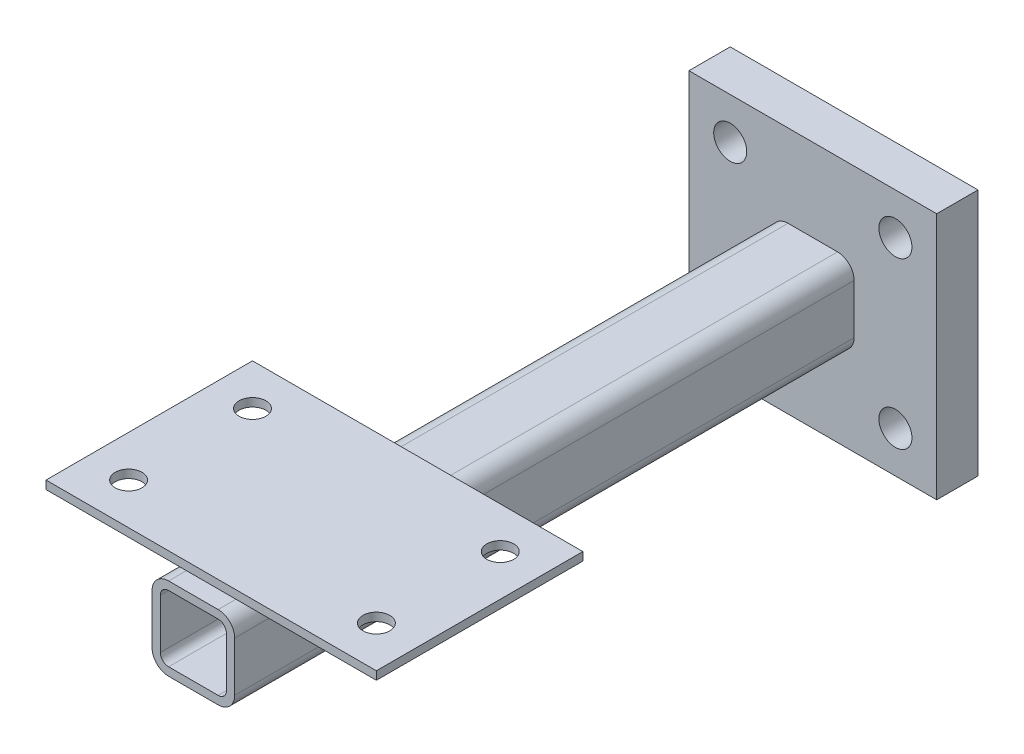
ISO-10303-21;
HEADER;
FILE_DESCRIPTION(('STEP AP214'),'2;1');
FILE_NAME('part.step','',(''),(''),'','','');
FILE_SCHEMA(('AUTOMOTIVE_DESIGN { 1 0 10303 214 1 1 1 1 }'));
ENDSEC;
DATA;
#1=APPLICATION_CONTEXT('core data for automotive mechanical design processes');
#2=APPLICATION_PROTOCOL_DEFINITION('international standard','automotive_design',2000,#1);
#3=PRODUCT_CONTEXT('',#1,'mechanical');
#4=PRODUCT('Part','Part','',(#3));
#5=PRODUCT_RELATED_PRODUCT_CATEGORY('part','',(#4));
#6=PRODUCT_DEFINITION_FORMATION('','',#4);
#7=PRODUCT_DEFINITION_CONTEXT('part definition',#1,'design');
#8=PRODUCT_DEFINITION('design','',#6,#7);
#9=PRODUCT_DEFINITION_SHAPE('','',#8);
#10=(LENGTH_UNIT() NAMED_UNIT(*) SI_UNIT(.MILLI.,.METRE.));
#11=(NAMED_UNIT(*) PLANE_ANGLE_UNIT() SI_UNIT($,.RADIAN.));
#12=(NAMED_UNIT(*) SI_UNIT($,.STERADIAN.) SOLID_ANGLE_UNIT());
#13=UNCERTAINTY_MEASURE_WITH_UNIT(LENGTH_MEASURE(1.E-05),#10,'distance_accuracy_value','');
#14=(GEOMETRIC_REPRESENTATION_CONTEXT(3) GLOBAL_UNCERTAINTY_ASSIGNED_CONTEXT((#13)) GLOBAL_UNIT_ASSIGNED_CONTEXT((#10,
#11,#12)) REPRESENTATION_CONTEXT('',''));
#15=CARTESIAN_POINT('',(0.,0.,0.));
#16=DIRECTION('',(0.,0.,1.));
#17=DIRECTION('',(1.,0.,0.));
#18=AXIS2_PLACEMENT_3D('',#15,#16,#17);
#19=CARTESIAN_POINT('',(40.,12.,105.685967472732));
#20=DIRECTION('',(-1.,0.,0.));
#21=DIRECTION('',(0.,0.,1.));
#22=AXIS2_PLACEMENT_3D('',#19,#20,#21);
#23=PLANE('',#22);
#24=DIRECTION('',(0.,0.,-1.));
#25=VECTOR('',#24,1.);
#26=CARTESIAN_POINT('',(40.,9.99999999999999,105.685967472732));
#27=LINE('',#26,#25);
#28=CARTESIAN_POINT('',(40.,9.99999999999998,155.685967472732));
#29=VERTEX_POINT('',#28);
#30=CARTESIAN_POINT('',(40.,9.99999999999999,105.685967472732));
#31=VERTEX_POINT('',#30);
#32=EDGE_CURVE('E170',#29,#31,#27,.T.);
#33=ORIENTED_EDGE('',*,*,#32,.T.);
#34=DIRECTION('',(0.,-1.,0.));
#35=VECTOR('',#34,1.);
#36=CARTESIAN_POINT('',(40.,12.,105.685967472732));
#37=LINE('',#36,#35);
#38=CARTESIAN_POINT('',(40.,12.,105.685967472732));
#39=VERTEX_POINT('',#38);
#40=EDGE_CURVE('E13',#39,#31,#37,.T.);
#41=ORIENTED_EDGE('',*,*,#40,.F.);
#42=DIRECTION('',(0.,0.,-1.));
#43=VECTOR('',#42,1.);
#44=CARTESIAN_POINT('',(40.,12.,105.685967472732));
#45=LINE('',#44,#43);
#46=CARTESIAN_POINT('',(40.,12.,155.685967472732));
#47=VERTEX_POINT('',#46);
#48=EDGE_CURVE('E152',#47,#39,#45,.T.);
#49=ORIENTED_EDGE('',*,*,#48,.F.);
#50=DIRECTION('',(0.,-1.,0.));
#51=VECTOR('',#50,1.);
#52=CARTESIAN_POINT('',(40.,12.,155.685967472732));
#53=LINE('',#52,#51);
#54=EDGE_CURVE('E166',#47,#29,#53,.T.);
#55=ORIENTED_EDGE('',*,*,#54,.T.);
#56=EDGE_LOOP('',(#33,#41,#49,#55));
#57=FACE_BOUND('',#56,.T.);
#58=ADVANCED_FACE('F91',(#57),#23,.F.);
#59=CARTESIAN_POINT('',(-40.,12.,105.685967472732));
#60=DIRECTION('',(0.,0.,1.));
#61=DIRECTION('',(0.,-1.,0.));
#62=AXIS2_PLACEMENT_3D('',#59,#60,#61);
#63=PLANE('',#62);
#64=DIRECTION('',(-1.,0.,0.));
#65=VECTOR('',#64,1.);
#66=CARTESIAN_POINT('',(-40.,9.99999999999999,105.685967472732));
#67=LINE('',#66,#65);
#68=CARTESIAN_POINT('',(-40.,9.99999999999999,105.685967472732));
#69=VERTEX_POINT('',#68);
#70=EDGE_CURVE('E157',#31,#69,#67,.T.);
#71=ORIENTED_EDGE('',*,*,#70,.T.);
#72=DIRECTION('',(0.,-1.,0.));
#73=VECTOR('',#72,1.);
#74=CARTESIAN_POINT('',(-40.,12.,105.685967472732));
#75=LINE('',#74,#73);
#76=CARTESIAN_POINT('',(-40.,12.,105.685967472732));
#77=VERTEX_POINT('',#76);
#78=EDGE_CURVE('E100',#77,#69,#75,.T.);
#79=ORIENTED_EDGE('',*,*,#78,.F.);
#80=DIRECTION('',(-1.,0.,0.));
#81=VECTOR('',#80,1.);
#82=CARTESIAN_POINT('',(-40.,12.,105.685967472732));
#83=LINE('',#82,#81);
#84=EDGE_CURVE('E146',#39,#77,#83,.T.);
#85=ORIENTED_EDGE('',*,*,#84,.F.);
#86=ORIENTED_EDGE('',*,*,#40,.T.);
#87=EDGE_LOOP('',(#71,#79,#85,#86));
#88=FACE_BOUND('',#87,.T.);
#89=ADVANCED_FACE('F156',(#88),#63,.F.);
#90=CARTESIAN_POINT('',(-40.,12.,105.685967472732));
#91=DIRECTION('',(1.,0.,0.));
#92=DIRECTION('',(0.,0.,-1.));
#93=AXIS2_PLACEMENT_3D('',#90,#91,#92);
#94=PLANE('',#93);
#95=DIRECTION('',(0.,0.,1.));
#96=VECTOR('',#95,1.);
#97=CARTESIAN_POINT('',(-40.,9.99999999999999,105.685967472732));
#98=LINE('',#97,#96);
#99=CARTESIAN_POINT('',(-40.,9.99999999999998,155.685967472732));
#100=VERTEX_POINT('',#99);
#101=EDGE_CURVE('E132',#69,#100,#98,.T.);
#102=ORIENTED_EDGE('',*,*,#101,.T.);
#103=DIRECTION('',(0.,-1.,0.));
#104=VECTOR('',#103,1.);
#105=CARTESIAN_POINT('',(-40.,12.,155.685967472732));
#106=LINE('',#105,#104);
#107=CARTESIAN_POINT('',(-40.,12.,155.685967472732));
#108=VERTEX_POINT('',#107);
#109=EDGE_CURVE('E158',#108,#100,#106,.T.);
#110=ORIENTED_EDGE('',*,*,#109,.F.);
#111=DIRECTION('',(0.,0.,1.));
#112=VECTOR('',#111,1.);
#113=CARTESIAN_POINT('',(-40.,12.,105.685967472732));
#114=LINE('',#113,#112);
#115=EDGE_CURVE('E150',#77,#108,#114,.T.);
#116=ORIENTED_EDGE('',*,*,#115,.F.);
#117=ORIENTED_EDGE('',*,*,#78,.T.);
#118=EDGE_LOOP('',(#102,#110,#116,#117));
#119=FACE_BOUND('',#118,.T.);
#120=ADVANCED_FACE('F160',(#119),#94,.F.);
#121=CARTESIAN_POINT('',(-40.,12.,155.685967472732));
#122=DIRECTION('',(0.,0.,-1.));
#123=DIRECTION('',(0.,1.,0.));
#124=AXIS2_PLACEMENT_3D('',#121,#122,#123);
#125=PLANE('',#124);
#126=DIRECTION('',(1.,0.,0.));
#127=VECTOR('',#126,1.);
#128=CARTESIAN_POINT('',(-40.,9.99999999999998,155.685967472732));
#129=LINE('',#128,#127);
#130=EDGE_CURVE('E138',#100,#29,#129,.T.);
#131=ORIENTED_EDGE('',*,*,#130,.T.);
#132=ORIENTED_EDGE('',*,*,#54,.F.);
#133=DIRECTION('',(1.,0.,0.));
#134=VECTOR('',#133,1.);
#135=CARTESIAN_POINT('',(-40.,12.,155.685967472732));
#136=LINE('',#135,#134);
#137=EDGE_CURVE('E112',#108,#47,#136,.T.);
#138=ORIENTED_EDGE('',*,*,#137,.F.);
#139=ORIENTED_EDGE('',*,*,#109,.T.);
#140=EDGE_LOOP('',(#131,#132,#138,#139));
#141=FACE_BOUND('',#140,.T.);
#142=ADVANCED_FACE('F228',(#141),#125,.F.);
#143=CARTESIAN_POINT('',(0.,12.,0.));
#144=DIRECTION('',(0.,1.,0.));
#145=DIRECTION('',(0.,0.,1.));
#146=AXIS2_PLACEMENT_3D('',#143,#144,#145);
#147=PLANE('',#146);
#148=CARTESIAN_POINT('',(-29.9999999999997,12.,145.685967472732));
#149=DIRECTION('',(0.,1.,0.));
#150=DIRECTION('',(0.,0.,1.));
#151=AXIS2_PLACEMENT_3D('',#148,#149,#150);
#152=CIRCLE('',#151,3.25);
#153=CARTESIAN_POINT('',(-29.9999999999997,12.,148.935967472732));
#154=VERTEX_POINT('',#153);
#155=EDGE_CURVE('E334',#154,#154,#152,.T.);
#156=ORIENTED_EDGE('',*,*,#155,.F.);
#157=EDGE_LOOP('',(#156));
#158=FACE_BOUND('',#157,.T.);
#159=CARTESIAN_POINT('',(30.0000000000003,12.,145.685967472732));
#160=DIRECTION('',(0.,1.,0.));
#161=DIRECTION('',(0.,0.,1.));
#162=AXIS2_PLACEMENT_3D('',#159,#160,#161);
#163=CIRCLE('',#162,3.25000000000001);
#164=CARTESIAN_POINT('',(30.0000000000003,12.,148.935967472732));
#165=VERTEX_POINT('',#164);
#166=EDGE_CURVE('E329',#165,#165,#163,.T.);
#167=ORIENTED_EDGE('',*,*,#166,.F.);
#168=EDGE_LOOP('',(#167));
#169=FACE_BOUND('',#168,.T.);
#170=CARTESIAN_POINT('',(30.,12.,115.685967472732));
#171=DIRECTION('',(0.,1.,0.));
#172=DIRECTION('',(0.,0.,1.));
#173=AXIS2_PLACEMENT_3D('',#170,#171,#172);
#174=CIRCLE('',#173,3.25);
#175=CARTESIAN_POINT('',(30.,12.,118.935967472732));
#176=VERTEX_POINT('',#175);
#177=EDGE_CURVE('E321',#176,#176,#174,.T.);
#178=ORIENTED_EDGE('',*,*,#177,.F.);
#179=EDGE_LOOP('',(#178));
#180=FACE_BOUND('',#179,.T.);
#181=CARTESIAN_POINT('',(-30.,12.,115.685967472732));
#182=DIRECTION('',(0.,1.,0.));
#183=DIRECTION('',(0.,0.,1.));
#184=AXIS2_PLACEMENT_3D('',#181,#182,#183);
#185=CIRCLE('',#184,3.25);
#186=CARTESIAN_POINT('',(-30.,12.,118.935967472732));
#187=VERTEX_POINT('',#186);
#188=EDGE_CURVE('E186',#187,#187,#185,.T.);
#189=ORIENTED_EDGE('',*,*,#188,.F.);
#190=EDGE_LOOP('',(#189));
#191=FACE_BOUND('',#190,.T.);
#192=ORIENTED_EDGE('',*,*,#48,.T.);
#193=ORIENTED_EDGE('',*,*,#84,.T.);
#194=ORIENTED_EDGE('',*,*,#115,.T.);
#195=ORIENTED_EDGE('',*,*,#137,.T.);
#196=EDGE_LOOP('',(#192,#193,#194,#195));
#197=FACE_BOUND('',#196,.T.);
#198=ADVANCED_FACE('F148',(#158,#169,#180,#191,#197),#147,.T.);
#199=CARTESIAN_POINT('',(0.,10.,0.));
#200=DIRECTION('',(0.,1.,0.));
#201=DIRECTION('',(0.,0.,1.));
#202=AXIS2_PLACEMENT_3D('',#199,#200,#201);
#203=PLANE('',#202);
#204=CARTESIAN_POINT('',(-29.9999999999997,9.99999999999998,145.685967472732));
#205=DIRECTION('',(0.,1.,0.));
#206=DIRECTION('',(0.,0.,1.));
#207=AXIS2_PLACEMENT_3D('',#204,#205,#206);
#208=CIRCLE('',#207,3.25);
#209=CARTESIAN_POINT('',(-29.9999999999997,9.99999999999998,148.935967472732));
#210=VERTEX_POINT('',#209);
#211=EDGE_CURVE('E94',#210,#210,#208,.T.);
#212=ORIENTED_EDGE('',*,*,#211,.T.);
#213=EDGE_LOOP('',(#212));
#214=FACE_BOUND('',#213,.T.);
#215=CARTESIAN_POINT('',(30.0000000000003,9.99999999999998,145.685967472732));
#216=DIRECTION('',(0.,1.,0.));
#217=DIRECTION('',(0.,0.,1.));
#218=AXIS2_PLACEMENT_3D('',#215,#216,#217);
#219=CIRCLE('',#218,3.25000000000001);
#220=CARTESIAN_POINT('',(30.0000000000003,9.99999999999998,148.935967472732));
#221=VERTEX_POINT('',#220);
#222=EDGE_CURVE('E189',#221,#221,#219,.T.);
#223=ORIENTED_EDGE('',*,*,#222,.T.);
#224=EDGE_LOOP('',(#223));
#225=FACE_BOUND('',#224,.T.);
#226=CARTESIAN_POINT('',(30.,9.99999999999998,115.685967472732));
#227=DIRECTION('',(0.,1.,0.));
#228=DIRECTION('',(0.,0.,1.));
#229=AXIS2_PLACEMENT_3D('',#226,#227,#228);
#230=CIRCLE('',#229,3.25);
#231=CARTESIAN_POINT('',(30.,9.99999999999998,118.935967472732));
#232=VERTEX_POINT('',#231);
#233=EDGE_CURVE('E185',#232,#232,#230,.T.);
#234=ORIENTED_EDGE('',*,*,#233,.T.);
#235=EDGE_LOOP('',(#234));
#236=FACE_BOUND('',#235,.T.);
#237=CARTESIAN_POINT('',(-30.,9.99999999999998,115.685967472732));
#238=DIRECTION('',(0.,1.,0.));
#239=DIRECTION('',(0.,0.,1.));
#240=AXIS2_PLACEMENT_3D('',#237,#238,#239);
#241=CIRCLE('',#240,3.25);
#242=CARTESIAN_POINT('',(-30.,9.99999999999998,118.935967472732));
#243=VERTEX_POINT('',#242);
#244=EDGE_CURVE('E181',#243,#243,#241,.T.);
#245=ORIENTED_EDGE('',*,*,#244,.T.);
#246=EDGE_LOOP('',(#245));
#247=FACE_BOUND('',#246,.T.);
#248=ORIENTED_EDGE('',*,*,#32,.F.);
#249=ORIENTED_EDGE('',*,*,#130,.F.);
#250=ORIENTED_EDGE('',*,*,#101,.F.);
#251=ORIENTED_EDGE('',*,*,#70,.F.);
#252=EDGE_LOOP('',(#248,#249,#250,#251));
#253=FACE_BOUND('',#252,.T.);
#254=ADVANCED_FACE('F200',(#214,#225,#236,#247,#253),#203,.F.);
#255=CARTESIAN_POINT('',(-30.,1.99999999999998,115.685967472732));
#256=DIRECTION('',(0.,1.,0.));
#257=DIRECTION('',(0.,0.,1.));
#258=AXIS2_PLACEMENT_3D('',#255,#256,#257);
#259=CYLINDRICAL_SURFACE('',#258,3.25);
#260=ORIENTED_EDGE('',*,*,#188,.T.);
#261=EDGE_LOOP('',(#260));
#262=FACE_BOUND('',#261,.T.);
#263=ORIENTED_EDGE('',*,*,#244,.F.);
#264=EDGE_LOOP('',(#263));
#265=FACE_BOUND('',#264,.T.);
#266=ADVANCED_FACE('F222',(#262,#265),#259,.F.);
#267=CARTESIAN_POINT('',(30.,1.99999999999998,115.685967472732));
#268=DIRECTION('',(0.,1.,0.));
#269=DIRECTION('',(0.,0.,1.));
#270=AXIS2_PLACEMENT_3D('',#267,#268,#269);
#271=CYLINDRICAL_SURFACE('',#270,3.25);
#272=ORIENTED_EDGE('',*,*,#177,.T.);
#273=EDGE_LOOP('',(#272));
#274=FACE_BOUND('',#273,.T.);
#275=ORIENTED_EDGE('',*,*,#233,.F.);
#276=EDGE_LOOP('',(#275));
#277=FACE_BOUND('',#276,.T.);
#278=ADVANCED_FACE('F209',(#274,#277),#271,.F.);
#279=CARTESIAN_POINT('',(30.0000000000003,1.99999999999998,145.685967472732));
#280=DIRECTION('',(0.,1.,0.));
#281=DIRECTION('',(0.,0.,1.));
#282=AXIS2_PLACEMENT_3D('',#279,#280,#281);
#283=CYLINDRICAL_SURFACE('',#282,3.25000000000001);
#284=ORIENTED_EDGE('',*,*,#166,.T.);
#285=EDGE_LOOP('',(#284));
#286=FACE_BOUND('',#285,.T.);
#287=ORIENTED_EDGE('',*,*,#222,.F.);
#288=EDGE_LOOP('',(#287));
#289=FACE_BOUND('',#288,.T.);
#290=ADVANCED_FACE('F204',(#286,#289),#283,.F.);
#291=CARTESIAN_POINT('',(-29.9999999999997,1.99999999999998,145.685967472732));
#292=DIRECTION('',(0.,1.,0.));
#293=DIRECTION('',(0.,0.,1.));
#294=AXIS2_PLACEMENT_3D('',#291,#292,#293);
#295=CYLINDRICAL_SURFACE('',#294,3.25);
#296=ORIENTED_EDGE('',*,*,#155,.T.);
#297=EDGE_LOOP('',(#296));
#298=FACE_BOUND('',#297,.T.);
#299=ORIENTED_EDGE('',*,*,#211,.F.);
#300=EDGE_LOOP('',(#299));
#301=FACE_BOUND('',#300,.T.);
#302=ADVANCED_FACE('F202',(#298,#301),#295,.F.);
#303=CLOSED_SHELL('',(#58,#89,#120,#142,#198,#254,#266,#278,#290,#302));
#304=MANIFOLD_SOLID_BREP('B2',#303);
#305=CARTESIAN_POINT('',(6.,-6.00000000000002,160.));
#306=DIRECTION('',(0.,0.,-1.));
#307=DIRECTION('',(0.,1.,0.));
#308=AXIS2_PLACEMENT_3D('',#305,#306,#307);
#309=CYLINDRICAL_SURFACE('',#308,4.);
#310=CARTESIAN_POINT('',(6.,-6.,10.));
#311=DIRECTION('',(0.,0.,1.));
#312=DIRECTION('',(0.,-1.,0.));
#313=AXIS2_PLACEMENT_3D('',#310,#311,#312);
#314=CIRCLE('',#313,4.);
#315=CARTESIAN_POINT('',(6.,-10.,10.));
#316=VERTEX_POINT('',#315);
#317=CARTESIAN_POINT('',(10.,-6.,10.));
#318=VERTEX_POINT('',#317);
#319=EDGE_CURVE('E527',#316,#318,#314,.T.);
#320=ORIENTED_EDGE('',*,*,#319,.T.);
#321=DIRECTION('',(0.,0.,-1.));
#322=VECTOR('',#321,1.);
#323=CARTESIAN_POINT('',(10.,-6.00000000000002,160.));
#324=LINE('',#323,#322);
#325=CARTESIAN_POINT('',(10.,-6.00000000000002,160.));
#326=VERTEX_POINT('',#325);
#327=EDGE_CURVE('E89',#326,#318,#324,.T.);
#328=ORIENTED_EDGE('',*,*,#327,.F.);
#329=CARTESIAN_POINT('',(6.,-6.00000000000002,160.));
#330=DIRECTION('',(0.,0.,1.));
#331=DIRECTION('',(0.,-1.,0.));
#332=AXIS2_PLACEMENT_3D('',#329,#330,#331);
#333=CIRCLE('',#332,4.);
#334=CARTESIAN_POINT('',(6.,-10.,160.));
#335=VERTEX_POINT('',#334);
#336=EDGE_CURVE('E605',#335,#326,#333,.T.);
#337=ORIENTED_EDGE('',*,*,#336,.F.);
#338=DIRECTION('',(0.,0.,-1.));
#339=VECTOR('',#338,1.);
#340=CARTESIAN_POINT('',(6.,-10.,160.));
#341=LINE('',#340,#339);
#342=EDGE_CURVE('E542',#335,#316,#341,.T.);
#343=ORIENTED_EDGE('',*,*,#342,.T.);
#344=EDGE_LOOP('',(#320,#328,#337,#343));
#345=FACE_BOUND('',#344,.T.);
#346=ADVANCED_FACE('F355',(#345),#309,.T.);
#347=CARTESIAN_POINT('',(10.,-6.00000000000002,160.));
#348=DIRECTION('',(-1.,0.,0.));
#349=DIRECTION('',(0.,0.,1.));
#350=AXIS2_PLACEMENT_3D('',#347,#348,#349);
#351=PLANE('',#350);
#352=DIRECTION('',(0.,1.,0.));
#353=VECTOR('',#352,1.);
#354=CARTESIAN_POINT('',(10.,-6.,10.));
#355=LINE('',#354,#353);
#356=CARTESIAN_POINT('',(10.,6.,10.));
#357=VERTEX_POINT('',#356);
#358=EDGE_CURVE('E530',#318,#357,#355,.T.);
#359=ORIENTED_EDGE('',*,*,#358,.T.);
#360=DIRECTION('',(0.,0.,-1.));
#361=VECTOR('',#360,1.);
#362=CARTESIAN_POINT('',(10.,5.99999999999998,160.));
#363=LINE('',#362,#361);
#364=CARTESIAN_POINT('',(10.,5.99999999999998,160.));
#365=VERTEX_POINT('',#364);
#366=EDGE_CURVE('E365',#365,#357,#363,.T.);
#367=ORIENTED_EDGE('',*,*,#366,.F.);
#368=DIRECTION('',(0.,1.,0.));
#369=VECTOR('',#368,1.);
#370=CARTESIAN_POINT('',(10.,-6.00000000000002,160.));
#371=LINE('',#370,#369);
#372=EDGE_CURVE('E607',#326,#365,#371,.T.);
#373=ORIENTED_EDGE('',*,*,#372,.F.);
#374=ORIENTED_EDGE('',*,*,#327,.T.);
#375=EDGE_LOOP('',(#359,#367,#373,#374));
#376=FACE_BOUND('',#375,.T.);
#377=ADVANCED_FACE('F642',(#376),#351,.F.);
#378=CARTESIAN_POINT('',(6.,5.99999999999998,160.));
#379=DIRECTION('',(0.,0.,-1.));
#380=DIRECTION('',(0.,1.,0.));
#381=AXIS2_PLACEMENT_3D('',#378,#379,#380);
#382=CYLINDRICAL_SURFACE('',#381,4.);
#383=CARTESIAN_POINT('',(6.,6.,10.));
#384=DIRECTION('',(0.,0.,1.));
#385=DIRECTION('',(0.,-1.,0.));
#386=AXIS2_PLACEMENT_3D('',#383,#384,#385);
#387=CIRCLE('',#386,4.);
#388=CARTESIAN_POINT('',(6.,10.,10.));
#389=VERTEX_POINT('',#388);
#390=EDGE_CURVE('E532',#357,#389,#387,.T.);
#391=ORIENTED_EDGE('',*,*,#390,.T.);
#392=DIRECTION('',(0.,0.,-1.));
#393=VECTOR('',#392,1.);
#394=CARTESIAN_POINT('',(6.,9.99999999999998,160.));
#395=LINE('',#394,#393);
#396=CARTESIAN_POINT('',(6.,9.99999999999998,160.));
#397=VERTEX_POINT('',#396);
#398=EDGE_CURVE('E549',#397,#389,#395,.T.);
#399=ORIENTED_EDGE('',*,*,#398,.F.);
#400=CARTESIAN_POINT('',(6.,5.99999999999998,160.));
#401=DIRECTION('',(0.,0.,1.));
#402=DIRECTION('',(0.,-1.,0.));
#403=AXIS2_PLACEMENT_3D('',#400,#401,#402);
#404=CIRCLE('',#403,4.);
#405=EDGE_CURVE('E609',#365,#397,#404,.T.);
#406=ORIENTED_EDGE('',*,*,#405,.F.);
#407=ORIENTED_EDGE('',*,*,#366,.T.);
#408=EDGE_LOOP('',(#391,#399,#406,#407));
#409=FACE_BOUND('',#408,.T.);
#410=ADVANCED_FACE('F647',(#409),#382,.T.);
#411=CARTESIAN_POINT('',(-6.,9.99999999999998,160.));
#412=DIRECTION('',(0.,-1.,0.));
#413=DIRECTION('',(0.,0.,-1.));
#414=AXIS2_PLACEMENT_3D('',#411,#412,#413);
#415=PLANE('',#414);
#416=DIRECTION('',(-1.,0.,0.));
#417=VECTOR('',#416,1.);
#418=CARTESIAN_POINT('',(-6.,10.,10.));
#419=LINE('',#418,#417);
#420=CARTESIAN_POINT('',(-6.,10.,10.));
#421=VERTEX_POINT('',#420);
#422=EDGE_CURVE('E534',#389,#421,#419,.T.);
#423=ORIENTED_EDGE('',*,*,#422,.T.);
#424=DIRECTION('',(0.,0.,-1.));
#425=VECTOR('',#424,1.);
#426=CARTESIAN_POINT('',(-6.,9.99999999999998,160.));
#427=LINE('',#426,#425);
#428=CARTESIAN_POINT('',(-6.,9.99999999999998,160.));
#429=VERTEX_POINT('',#428);
#430=EDGE_CURVE('E546',#429,#421,#427,.T.);
#431=ORIENTED_EDGE('',*,*,#430,.F.);
#432=DIRECTION('',(-1.,0.,0.));
#433=VECTOR('',#432,1.);
#434=CARTESIAN_POINT('',(-6.,9.99999999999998,160.));
#435=LINE('',#434,#433);
#436=EDGE_CURVE('E611',#397,#429,#435,.T.);
#437=ORIENTED_EDGE('',*,*,#436,.F.);
#438=ORIENTED_EDGE('',*,*,#398,.T.);
#439=EDGE_LOOP('',(#423,#431,#437,#438));
#440=FACE_BOUND('',#439,.T.);
#441=ADVANCED_FACE('F617',(#440),#415,.F.);
#442=CARTESIAN_POINT('',(-6.,5.99999999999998,160.));
#443=DIRECTION('',(0.,0.,-1.));
#444=DIRECTION('',(0.,1.,0.));
#445=AXIS2_PLACEMENT_3D('',#442,#443,#444);
#446=CYLINDRICAL_SURFACE('',#445,4.);
#447=CARTESIAN_POINT('',(-6.,6.,10.));
#448=DIRECTION('',(0.,0.,1.));
#449=DIRECTION('',(0.,-1.,0.));
#450=AXIS2_PLACEMENT_3D('',#447,#448,#449);
#451=CIRCLE('',#450,4.);
#452=CARTESIAN_POINT('',(-10.,6.,10.));
#453=VERTEX_POINT('',#452);
#454=EDGE_CURVE('E536',#421,#453,#451,.T.);
#455=ORIENTED_EDGE('',*,*,#454,.T.);
#456=DIRECTION('',(0.,0.,-1.));
#457=VECTOR('',#456,1.);
#458=CARTESIAN_POINT('',(-10.,5.99999999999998,160.));
#459=LINE('',#458,#457);
#460=CARTESIAN_POINT('',(-10.,5.99999999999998,160.));
#461=VERTEX_POINT('',#460);
#462=EDGE_CURVE('E494',#461,#453,#459,.T.);
#463=ORIENTED_EDGE('',*,*,#462,.F.);
#464=CARTESIAN_POINT('',(-6.,5.99999999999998,160.));
#465=DIRECTION('',(0.,0.,1.));
#466=DIRECTION('',(0.,-1.,0.));
#467=AXIS2_PLACEMENT_3D('',#464,#465,#466);
#468=CIRCLE('',#467,4.);
#469=EDGE_CURVE('E485',#429,#461,#468,.T.);
#470=ORIENTED_EDGE('',*,*,#469,.F.);
#471=ORIENTED_EDGE('',*,*,#430,.T.);
#472=EDGE_LOOP('',(#455,#463,#470,#471));
#473=FACE_BOUND('',#472,.T.);
#474=ADVANCED_FACE('F621',(#473),#446,.T.);
#475=CARTESIAN_POINT('',(-10.,5.99999999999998,160.));
#476=DIRECTION('',(1.,0.,0.));
#477=DIRECTION('',(0.,0.,-1.));
#478=AXIS2_PLACEMENT_3D('',#475,#476,#477);
#479=PLANE('',#478);
#480=DIRECTION('',(0.,-1.,0.));
#481=VECTOR('',#480,1.);
#482=CARTESIAN_POINT('',(-10.,6.,10.));
#483=LINE('',#482,#481);
#484=CARTESIAN_POINT('',(-10.,-6.,10.));
#485=VERTEX_POINT('',#484);
#486=EDGE_CURVE('E493',#453,#485,#483,.T.);
#487=ORIENTED_EDGE('',*,*,#486,.T.);
#488=DIRECTION('',(0.,0.,-1.));
#489=VECTOR('',#488,1.);
#490=CARTESIAN_POINT('',(-10.,-6.00000000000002,160.));
#491=LINE('',#490,#489);
#492=CARTESIAN_POINT('',(-10.,-6.00000000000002,160.));
#493=VERTEX_POINT('',#492);
#494=EDGE_CURVE('E490',#493,#485,#491,.T.);
#495=ORIENTED_EDGE('',*,*,#494,.F.);
#496=DIRECTION('',(0.,-1.,0.));
#497=VECTOR('',#496,1.);
#498=CARTESIAN_POINT('',(-10.,5.99999999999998,160.));
#499=LINE('',#498,#497);
#500=EDGE_CURVE('E479',#461,#493,#499,.T.);
#501=ORIENTED_EDGE('',*,*,#500,.F.);
#502=ORIENTED_EDGE('',*,*,#462,.T.);
#503=EDGE_LOOP('',(#487,#495,#501,#502));
#504=FACE_BOUND('',#503,.T.);
#505=ADVANCED_FACE('F491',(#504),#479,.F.);
#506=CARTESIAN_POINT('',(-6.,-6.00000000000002,160.));
#507=DIRECTION('',(0.,0.,-1.));
#508=DIRECTION('',(0.,1.,0.));
#509=AXIS2_PLACEMENT_3D('',#506,#507,#508);
#510=CYLINDRICAL_SURFACE('',#509,4.);
#511=CARTESIAN_POINT('',(-6.,-6.,10.));
#512=DIRECTION('',(0.,0.,1.));
#513=DIRECTION('',(0.,-1.,0.));
#514=AXIS2_PLACEMENT_3D('',#511,#512,#513);
#515=CIRCLE('',#514,4.);
#516=CARTESIAN_POINT('',(-6.,-10.,10.));
#517=VERTEX_POINT('',#516);
#518=EDGE_CURVE('E427',#485,#517,#515,.T.);
#519=ORIENTED_EDGE('',*,*,#518,.T.);
#520=DIRECTION('',(0.,0.,-1.));
#521=VECTOR('',#520,1.);
#522=CARTESIAN_POINT('',(-6.,-10.,160.));
#523=LINE('',#522,#521);
#524=CARTESIAN_POINT('',(-6.,-10.,160.));
#525=VERTEX_POINT('',#524);
#526=EDGE_CURVE('E495',#525,#517,#523,.T.);
#527=ORIENTED_EDGE('',*,*,#526,.F.);
#528=CARTESIAN_POINT('',(-6.,-6.00000000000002,160.));
#529=DIRECTION('',(0.,0.,1.));
#530=DIRECTION('',(0.,-1.,0.));
#531=AXIS2_PLACEMENT_3D('',#528,#529,#530);
#532=CIRCLE('',#531,4.);
#533=EDGE_CURVE('E483',#493,#525,#532,.T.);
#534=ORIENTED_EDGE('',*,*,#533,.F.);
#535=ORIENTED_EDGE('',*,*,#494,.T.);
#536=EDGE_LOOP('',(#519,#527,#534,#535));
#537=FACE_BOUND('',#536,.T.);
#538=ADVANCED_FACE('F497',(#537),#510,.T.);
#539=CARTESIAN_POINT('',(6.,5.99999999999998,160.));
#540=DIRECTION('',(0.,0.,-1.));
#541=DIRECTION('',(0.,1.,0.));
#542=AXIS2_PLACEMENT_3D('',#539,#540,#541);
#543=CYLINDRICAL_SURFACE('',#542,2.);
#544=CARTESIAN_POINT('',(6.,6.,10.));
#545=DIRECTION('',(0.,0.,1.));
#546=DIRECTION('',(0.,-1.,0.));
#547=AXIS2_PLACEMENT_3D('',#544,#545,#546);
#548=CIRCLE('',#547,2.);
#549=CARTESIAN_POINT('',(8.,6.,10.));
#550=VERTEX_POINT('',#549);
#551=CARTESIAN_POINT('',(6.,8.,10.));
#552=VERTEX_POINT('',#551);
#553=EDGE_CURVE('E503',#550,#552,#548,.T.);
#554=ORIENTED_EDGE('',*,*,#553,.F.);
#555=DIRECTION('',(0.,0.,-1.));
#556=VECTOR('',#555,1.);
#557=CARTESIAN_POINT('',(8.,5.99999999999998,160.));
#558=LINE('',#557,#556);
#559=CARTESIAN_POINT('',(8.,5.99999999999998,160.));
#560=VERTEX_POINT('',#559);
#561=EDGE_CURVE('E359',#560,#550,#558,.T.);
#562=ORIENTED_EDGE('',*,*,#561,.F.);
#563=CARTESIAN_POINT('',(6.,5.99999999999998,160.));
#564=DIRECTION('',(0.,0.,1.));
#565=DIRECTION('',(0.,-1.,0.));
#566=AXIS2_PLACEMENT_3D('',#563,#564,#565);
#567=CIRCLE('',#566,2.);
#568=CARTESIAN_POINT('',(6.,7.99999999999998,160.));
#569=VERTEX_POINT('',#568);
#570=EDGE_CURVE('E541',#560,#569,#567,.T.);
#571=ORIENTED_EDGE('',*,*,#570,.T.);
#572=DIRECTION('',(0.,0.,-1.));
#573=VECTOR('',#572,1.);
#574=CARTESIAN_POINT('',(6.,7.99999999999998,160.));
#575=LINE('',#574,#573);
#576=EDGE_CURVE('E499',#569,#552,#575,.T.);
#577=ORIENTED_EDGE('',*,*,#576,.T.);
#578=EDGE_LOOP('',(#554,#562,#571,#577));
#579=FACE_BOUND('',#578,.T.);
#580=ADVANCED_FACE('F357',(#579),#543,.F.);
#581=CARTESIAN_POINT('',(8.,-6.00000000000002,160.));
#582=DIRECTION('',(-1.,0.,0.));
#583=DIRECTION('',(0.,0.,1.));
#584=AXIS2_PLACEMENT_3D('',#581,#582,#583);
#585=PLANE('',#584);
#586=DIRECTION('',(0.,1.,0.));
#587=VECTOR('',#586,1.);
#588=CARTESIAN_POINT('',(8.,-6.,10.));
#589=LINE('',#588,#587);
#590=CARTESIAN_POINT('',(8.,-6.,10.));
#591=VERTEX_POINT('',#590);
#592=EDGE_CURVE('E506',#591,#550,#589,.T.);
#593=ORIENTED_EDGE('',*,*,#592,.F.);
#594=DIRECTION('',(0.,0.,-1.));
#595=VECTOR('',#594,1.);
#596=CARTESIAN_POINT('',(8.,-6.00000000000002,160.));
#597=LINE('',#596,#595);
#598=CARTESIAN_POINT('',(8.,-6.00000000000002,160.));
#599=VERTEX_POINT('',#598);
#600=EDGE_CURVE('E564',#599,#591,#597,.T.);
#601=ORIENTED_EDGE('',*,*,#600,.F.);
#602=DIRECTION('',(0.,1.,0.));
#603=VECTOR('',#602,1.);
#604=CARTESIAN_POINT('',(8.,-6.00000000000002,160.));
#605=LINE('',#604,#603);
#606=EDGE_CURVE('E573',#599,#560,#605,.T.);
#607=ORIENTED_EDGE('',*,*,#606,.T.);
#608=ORIENTED_EDGE('',*,*,#561,.T.);
#609=EDGE_LOOP('',(#593,#601,#607,#608));
#610=FACE_BOUND('',#609,.T.);
#611=ADVANCED_FACE('F571',(#610),#585,.T.);
#612=CARTESIAN_POINT('',(6.,-6.00000000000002,160.));
#613=DIRECTION('',(0.,0.,-1.));
#614=DIRECTION('',(0.,1.,0.));
#615=AXIS2_PLACEMENT_3D('',#612,#613,#614);
#616=CYLINDRICAL_SURFACE('',#615,2.);
#617=CARTESIAN_POINT('',(6.,-6.,10.));
#618=DIRECTION('',(0.,0.,1.));
#619=DIRECTION('',(0.,-1.,0.));
#620=AXIS2_PLACEMENT_3D('',#617,#618,#619);
#621=CIRCLE('',#620,2.);
#622=CARTESIAN_POINT('',(6.,-8.,10.));
#623=VERTEX_POINT('',#622);
#624=EDGE_CURVE('E509',#623,#591,#621,.T.);
#625=ORIENTED_EDGE('',*,*,#624,.F.);
#626=DIRECTION('',(0.,0.,-1.));
#627=VECTOR('',#626,1.);
#628=CARTESIAN_POINT('',(6.,-8.00000000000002,160.));
#629=LINE('',#628,#627);
#630=CARTESIAN_POINT('',(6.,-8.00000000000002,160.));
#631=VERTEX_POINT('',#630);
#632=EDGE_CURVE('E563',#631,#623,#629,.T.);
#633=ORIENTED_EDGE('',*,*,#632,.F.);
#634=CARTESIAN_POINT('',(6.,-6.00000000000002,160.));
#635=DIRECTION('',(0.,0.,1.));
#636=DIRECTION('',(0.,-1.,0.));
#637=AXIS2_PLACEMENT_3D('',#634,#635,#636);
#638=CIRCLE('',#637,2.);
#639=EDGE_CURVE('E581',#631,#599,#638,.T.);
#640=ORIENTED_EDGE('',*,*,#639,.T.);
#641=ORIENTED_EDGE('',*,*,#600,.T.);
#642=EDGE_LOOP('',(#625,#633,#640,#641));
#643=FACE_BOUND('',#642,.T.);
#644=ADVANCED_FACE('F579',(#643),#616,.F.);
#645=CARTESIAN_POINT('',(6.,-8.00000000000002,160.));
#646=DIRECTION('',(0.,1.,0.));
#647=DIRECTION('',(0.,0.,1.));
#648=AXIS2_PLACEMENT_3D('',#645,#646,#647);
#649=PLANE('',#648);
#650=DIRECTION('',(1.,0.,0.));
#651=VECTOR('',#650,1.);
#652=CARTESIAN_POINT('',(6.,-8.,10.));
#653=LINE('',#652,#651);
#654=CARTESIAN_POINT('',(-6.,-8.,10.));
#655=VERTEX_POINT('',#654);
#656=EDGE_CURVE('E512',#655,#623,#653,.T.);
#657=ORIENTED_EDGE('',*,*,#656,.F.);
#658=DIRECTION('',(0.,0.,-1.));
#659=VECTOR('',#658,1.);
#660=CARTESIAN_POINT('',(-6.,-8.00000000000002,160.));
#661=LINE('',#660,#659);
#662=CARTESIAN_POINT('',(-6.,-8.00000000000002,160.));
#663=VERTEX_POINT('',#662);
#664=EDGE_CURVE('E561',#663,#655,#661,.T.);
#665=ORIENTED_EDGE('',*,*,#664,.F.);
#666=DIRECTION('',(1.,0.,0.));
#667=VECTOR('',#666,1.);
#668=CARTESIAN_POINT('',(6.,-8.00000000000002,160.));
#669=LINE('',#668,#667);
#670=EDGE_CURVE('E587',#663,#631,#669,.T.);
#671=ORIENTED_EDGE('',*,*,#670,.T.);
#672=ORIENTED_EDGE('',*,*,#632,.T.);
#673=EDGE_LOOP('',(#657,#665,#671,#672));
#674=FACE_BOUND('',#673,.T.);
#675=ADVANCED_FACE('F590',(#674),#649,.T.);
#676=CARTESIAN_POINT('',(-6.,-6.00000000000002,160.));
#677=DIRECTION('',(0.,0.,-1.));
#678=DIRECTION('',(0.,1.,0.));
#679=AXIS2_PLACEMENT_3D('',#676,#677,#678);
#680=CYLINDRICAL_SURFACE('',#679,2.);
#681=CARTESIAN_POINT('',(-6.,-6.,10.));
#682=DIRECTION('',(0.,0.,1.));
#683=DIRECTION('',(0.,-1.,0.));
#684=AXIS2_PLACEMENT_3D('',#681,#682,#683);
#685=CIRCLE('',#684,2.);
#686=CARTESIAN_POINT('',(-8.,-6.,10.));
#687=VERTEX_POINT('',#686);
#688=EDGE_CURVE('E515',#687,#655,#685,.T.);
#689=ORIENTED_EDGE('',*,*,#688,.F.);
#690=DIRECTION('',(0.,0.,-1.));
#691=VECTOR('',#690,1.);
#692=CARTESIAN_POINT('',(-8.,-6.00000000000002,160.));
#693=LINE('',#692,#691);
#694=CARTESIAN_POINT('',(-8.,-6.00000000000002,160.));
#695=VERTEX_POINT('',#694);
#696=EDGE_CURVE('E559',#695,#687,#693,.T.);
#697=ORIENTED_EDGE('',*,*,#696,.F.);
#698=CARTESIAN_POINT('',(-6.,-6.00000000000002,160.));
#699=DIRECTION('',(0.,0.,1.));
#700=DIRECTION('',(0.,-1.,0.));
#701=AXIS2_PLACEMENT_3D('',#698,#699,#700);
#702=CIRCLE('',#701,2.);
#703=EDGE_CURVE('E591',#695,#663,#702,.T.);
#704=ORIENTED_EDGE('',*,*,#703,.T.);
#705=ORIENTED_EDGE('',*,*,#664,.T.);
#706=EDGE_LOOP('',(#689,#697,#704,#705));
#707=FACE_BOUND('',#706,.T.);
#708=ADVANCED_FACE('F658',(#707),#680,.F.);
#709=CARTESIAN_POINT('',(-8.,5.99999999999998,160.));
#710=DIRECTION('',(1.,0.,0.));
#711=DIRECTION('',(0.,0.,-1.));
#712=AXIS2_PLACEMENT_3D('',#709,#710,#711);
#713=PLANE('',#712);
#714=DIRECTION('',(0.,-1.,0.));
#715=VECTOR('',#714,1.);
#716=CARTESIAN_POINT('',(-8.,6.,10.));
#717=LINE('',#716,#715);
#718=CARTESIAN_POINT('',(-8.,6.,10.));
#719=VERTEX_POINT('',#718);
#720=EDGE_CURVE('E518',#719,#687,#717,.T.);
#721=ORIENTED_EDGE('',*,*,#720,.F.);
#722=DIRECTION('',(0.,0.,-1.));
#723=VECTOR('',#722,1.);
#724=CARTESIAN_POINT('',(-8.,5.99999999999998,160.));
#725=LINE('',#724,#723);
#726=CARTESIAN_POINT('',(-8.,5.99999999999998,160.));
#727=VERTEX_POINT('',#726);
#728=EDGE_CURVE('E557',#727,#719,#725,.T.);
#729=ORIENTED_EDGE('',*,*,#728,.F.);
#730=DIRECTION('',(0.,-1.,0.));
#731=VECTOR('',#730,1.);
#732=CARTESIAN_POINT('',(-8.,5.99999999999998,160.));
#733=LINE('',#732,#731);
#734=EDGE_CURVE('E593',#727,#695,#733,.T.);
#735=ORIENTED_EDGE('',*,*,#734,.T.);
#736=ORIENTED_EDGE('',*,*,#696,.T.);
#737=EDGE_LOOP('',(#721,#729,#735,#736));
#738=FACE_BOUND('',#737,.T.);
#739=ADVANCED_FACE('F654',(#738),#713,.T.);
#740=CARTESIAN_POINT('',(-6.,5.99999999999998,160.));
#741=DIRECTION('',(0.,0.,-1.));
#742=DIRECTION('',(0.,1.,0.));
#743=AXIS2_PLACEMENT_3D('',#740,#741,#742);
#744=CYLINDRICAL_SURFACE('',#743,2.);
#745=CARTESIAN_POINT('',(-6.,6.,10.));
#746=DIRECTION('',(0.,0.,1.));
#747=DIRECTION('',(0.,-1.,0.));
#748=AXIS2_PLACEMENT_3D('',#745,#746,#747);
#749=CIRCLE('',#748,2.);
#750=CARTESIAN_POINT('',(-6.,8.,10.));
#751=VERTEX_POINT('',#750);
#752=EDGE_CURVE('E521',#751,#719,#749,.T.);
#753=ORIENTED_EDGE('',*,*,#752,.F.);
#754=DIRECTION('',(0.,0.,-1.));
#755=VECTOR('',#754,1.);
#756=CARTESIAN_POINT('',(-6.,7.99999999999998,160.));
#757=LINE('',#756,#755);
#758=CARTESIAN_POINT('',(-6.,7.99999999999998,160.));
#759=VERTEX_POINT('',#758);
#760=EDGE_CURVE('E555',#759,#751,#757,.T.);
#761=ORIENTED_EDGE('',*,*,#760,.F.);
#762=CARTESIAN_POINT('',(-6.,5.99999999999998,160.));
#763=DIRECTION('',(0.,0.,1.));
#764=DIRECTION('',(0.,-1.,0.));
#765=AXIS2_PLACEMENT_3D('',#762,#763,#764);
#766=CIRCLE('',#765,2.);
#767=EDGE_CURVE('E599',#759,#727,#766,.T.);
#768=ORIENTED_EDGE('',*,*,#767,.T.);
#769=ORIENTED_EDGE('',*,*,#728,.T.);
#770=EDGE_LOOP('',(#753,#761,#768,#769));
#771=FACE_BOUND('',#770,.T.);
#772=ADVANCED_FACE('F636',(#771),#744,.F.);
#773=CARTESIAN_POINT('',(-6.,7.99999999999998,160.));
#774=DIRECTION('',(0.,-1.,0.));
#775=DIRECTION('',(0.,0.,-1.));
#776=AXIS2_PLACEMENT_3D('',#773,#774,#775);
#777=PLANE('',#776);
#778=DIRECTION('',(-1.,0.,0.));
#779=VECTOR('',#778,1.);
#780=CARTESIAN_POINT('',(-6.,8.,10.));
#781=LINE('',#780,#779);
#782=EDGE_CURVE('E524',#552,#751,#781,.T.);
#783=ORIENTED_EDGE('',*,*,#782,.F.);
#784=ORIENTED_EDGE('',*,*,#576,.F.);
#785=DIRECTION('',(-1.,0.,0.));
#786=VECTOR('',#785,1.);
#787=CARTESIAN_POINT('',(-6.,7.99999999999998,160.));
#788=LINE('',#787,#786);
#789=EDGE_CURVE('E602',#569,#759,#788,.T.);
#790=ORIENTED_EDGE('',*,*,#789,.T.);
#791=ORIENTED_EDGE('',*,*,#760,.T.);
#792=EDGE_LOOP('',(#783,#784,#790,#791));
#793=FACE_BOUND('',#792,.T.);
#794=ADVANCED_FACE('F629',(#793),#777,.T.);
#795=CARTESIAN_POINT('',(6.,-10.,160.));
#796=DIRECTION('',(0.,1.,0.));
#797=DIRECTION('',(0.,0.,1.));
#798=AXIS2_PLACEMENT_3D('',#795,#796,#797);
#799=PLANE('',#798);
#800=DIRECTION('',(1.,0.,0.));
#801=VECTOR('',#800,1.);
#802=CARTESIAN_POINT('',(6.,-10.,10.));
#803=LINE('',#802,#801);
#804=EDGE_CURVE('E433',#517,#316,#803,.T.);
#805=ORIENTED_EDGE('',*,*,#804,.T.);
#806=ORIENTED_EDGE('',*,*,#342,.F.);
#807=DIRECTION('',(1.,0.,0.));
#808=VECTOR('',#807,1.);
#809=CARTESIAN_POINT('',(6.,-10.,160.));
#810=LINE('',#809,#808);
#811=EDGE_CURVE('E374',#525,#335,#810,.T.);
#812=ORIENTED_EDGE('',*,*,#811,.F.);
#813=ORIENTED_EDGE('',*,*,#526,.T.);
#814=EDGE_LOOP('',(#805,#806,#812,#813));
#815=FACE_BOUND('',#814,.T.);
#816=ADVANCED_FACE('F627',(#815),#799,.F.);
#817=CARTESIAN_POINT('',(6.,-6.00000000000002,160.));
#818=DIRECTION('',(0.,0.,1.));
#819=DIRECTION('',(0.,-1.,0.));
#820=AXIS2_PLACEMENT_3D('',#817,#818,#819);
#821=PLANE('',#820);
#822=ORIENTED_EDGE('',*,*,#570,.F.);
#823=ORIENTED_EDGE('',*,*,#606,.F.);
#824=ORIENTED_EDGE('',*,*,#639,.F.);
#825=ORIENTED_EDGE('',*,*,#670,.F.);
#826=ORIENTED_EDGE('',*,*,#703,.F.);
#827=ORIENTED_EDGE('',*,*,#734,.F.);
#828=ORIENTED_EDGE('',*,*,#767,.F.);
#829=ORIENTED_EDGE('',*,*,#789,.F.);
#830=EDGE_LOOP('',(#822,#823,#824,#825,#826,#827,#828,#829));
#831=FACE_BOUND('',#830,.T.);
#832=ORIENTED_EDGE('',*,*,#336,.T.);
#833=ORIENTED_EDGE('',*,*,#372,.T.);
#834=ORIENTED_EDGE('',*,*,#405,.T.);
#835=ORIENTED_EDGE('',*,*,#436,.T.);
#836=ORIENTED_EDGE('',*,*,#469,.T.);
#837=ORIENTED_EDGE('',*,*,#500,.T.);
#838=ORIENTED_EDGE('',*,*,#533,.T.);
#839=ORIENTED_EDGE('',*,*,#811,.T.);
#840=EDGE_LOOP('',(#832,#833,#834,#835,#836,#837,#838,#839));
#841=FACE_BOUND('',#840,.T.);
#842=ADVANCED_FACE('F481',(#831,#841),#821,.T.);
#843=CARTESIAN_POINT('',(6.,-6.,10.));
#844=DIRECTION('',(0.,0.,1.));
#845=DIRECTION('',(0.,-1.,0.));
#846=AXIS2_PLACEMENT_3D('',#843,#844,#845);
#847=PLANE('',#846);
#848=ORIENTED_EDGE('',*,*,#553,.T.);
#849=ORIENTED_EDGE('',*,*,#782,.T.);
#850=ORIENTED_EDGE('',*,*,#752,.T.);
#851=ORIENTED_EDGE('',*,*,#720,.T.);
#852=ORIENTED_EDGE('',*,*,#688,.T.);
#853=ORIENTED_EDGE('',*,*,#656,.T.);
#854=ORIENTED_EDGE('',*,*,#624,.T.);
#855=ORIENTED_EDGE('',*,*,#592,.T.);
#856=EDGE_LOOP('',(#848,#849,#850,#851,#852,#853,#854,#855));
#857=FACE_BOUND('',#856,.T.);
#858=ORIENTED_EDGE('',*,*,#319,.F.);
#859=ORIENTED_EDGE('',*,*,#804,.F.);
#860=ORIENTED_EDGE('',*,*,#518,.F.);
#861=ORIENTED_EDGE('',*,*,#486,.F.);
#862=ORIENTED_EDGE('',*,*,#454,.F.);
#863=ORIENTED_EDGE('',*,*,#422,.F.);
#864=ORIENTED_EDGE('',*,*,#390,.F.);
#865=ORIENTED_EDGE('',*,*,#358,.F.);
#866=EDGE_LOOP('',(#858,#859,#860,#861,#862,#863,#864,#865));
#867=FACE_BOUND('',#866,.T.);
#868=ADVANCED_FACE('F576',(#857,#867),#847,.F.);
#869=CLOSED_SHELL('',(#346,#377,#410,#441,#474,#505,#538,#580,#611,#644,#675,#708,#739,#772,
#794,#816,#842,#868));
#870=MANIFOLD_SOLID_BREP('B7',#869);
#871=CARTESIAN_POINT('',(30.,30.,10.));
#872=DIRECTION('',(-1.,0.,0.));
#873=DIRECTION('',(0.,-1.,0.));
#874=AXIS2_PLACEMENT_3D('',#871,#872,#873);
#875=PLANE('',#874);
#876=DIRECTION('',(0.,1.,0.));
#877=VECTOR('',#876,1.);
#878=CARTESIAN_POINT('',(30.,30.,0.));
#879=LINE('',#878,#877);
#880=CARTESIAN_POINT('',(30.,-30.,0.));
#881=VERTEX_POINT('',#880);
#882=CARTESIAN_POINT('',(30.,30.,0.));
#883=VERTEX_POINT('',#882);
#884=EDGE_CURVE('E892',#881,#883,#879,.T.);
#885=ORIENTED_EDGE('',*,*,#884,.T.);
#886=DIRECTION('',(0.,0.,-1.));
#887=VECTOR('',#886,1.);
#888=CARTESIAN_POINT('',(30.,30.,10.));
#889=LINE('',#888,#887);
#890=CARTESIAN_POINT('',(30.,30.,10.));
#891=VERTEX_POINT('',#890);
#892=EDGE_CURVE('E353',#891,#883,#889,.T.);
#893=ORIENTED_EDGE('',*,*,#892,.F.);
#894=DIRECTION('',(0.,1.,0.));
#895=VECTOR('',#894,1.);
#896=CARTESIAN_POINT('',(30.,30.,10.));
#897=LINE('',#896,#895);
#898=CARTESIAN_POINT('',(30.,-30.,10.));
#899=VERTEX_POINT('',#898);
#900=EDGE_CURVE('E880',#899,#891,#897,.T.);
#901=ORIENTED_EDGE('',*,*,#900,.F.);
#902=DIRECTION('',(0.,0.,-1.));
#903=VECTOR('',#902,1.);
#904=CARTESIAN_POINT('',(30.,-30.,10.));
#905=LINE('',#904,#903);
#906=EDGE_CURVE('E888',#899,#881,#905,.T.);
#907=ORIENTED_EDGE('',*,*,#906,.T.);
#908=EDGE_LOOP('',(#885,#893,#901,#907));
#909=FACE_BOUND('',#908,.T.);
#910=ADVANCED_FACE('F829',(#909),#875,.F.);
#911=CARTESIAN_POINT('',(-30.,30.,10.));
#912=DIRECTION('',(0.,-1.,0.));
#913=DIRECTION('',(0.,0.,-1.));
#914=AXIS2_PLACEMENT_3D('',#911,#912,#913);
#915=PLANE('',#914);
#916=DIRECTION('',(-1.,0.,0.));
#917=VECTOR('',#916,1.);
#918=CARTESIAN_POINT('',(-30.,30.,0.));
#919=LINE('',#918,#917);
#920=CARTESIAN_POINT('',(-30.,30.,0.));
#921=VERTEX_POINT('',#920);
#922=EDGE_CURVE('E884',#883,#921,#919,.T.);
#923=ORIENTED_EDGE('',*,*,#922,.T.);
#924=DIRECTION('',(0.,0.,-1.));
#925=VECTOR('',#924,1.);
#926=CARTESIAN_POINT('',(-30.,30.,10.));
#927=LINE('',#926,#925);
#928=CARTESIAN_POINT('',(-30.,30.,10.));
#929=VERTEX_POINT('',#928);
#930=EDGE_CURVE('E837',#929,#921,#927,.T.);
#931=ORIENTED_EDGE('',*,*,#930,.F.);
#932=DIRECTION('',(-1.,0.,0.));
#933=VECTOR('',#932,1.);
#934=CARTESIAN_POINT('',(-30.,30.,10.));
#935=LINE('',#934,#933);
#936=EDGE_CURVE('E875',#891,#929,#935,.T.);
#937=ORIENTED_EDGE('',*,*,#936,.F.);
#938=ORIENTED_EDGE('',*,*,#892,.T.);
#939=EDGE_LOOP('',(#923,#931,#937,#938));
#940=FACE_BOUND('',#939,.T.);
#941=ADVANCED_FACE('F883',(#940),#915,.F.);
#942=CARTESIAN_POINT('',(-30.,30.,10.));
#943=DIRECTION('',(1.,0.,0.));
#944=DIRECTION('',(0.,0.,-1.));
#945=AXIS2_PLACEMENT_3D('',#942,#943,#944);
#946=PLANE('',#945);
#947=DIRECTION('',(0.,-1.,0.));
#948=VECTOR('',#947,1.);
#949=CARTESIAN_POINT('',(-30.,30.,0.));
#950=LINE('',#949,#948);
#951=CARTESIAN_POINT('',(-30.,-30.,0.));
#952=VERTEX_POINT('',#951);
#953=EDGE_CURVE('E862',#921,#952,#950,.T.);
#954=ORIENTED_EDGE('',*,*,#953,.T.);
#955=DIRECTION('',(0.,0.,-1.));
#956=VECTOR('',#955,1.);
#957=CARTESIAN_POINT('',(-30.,-30.,10.));
#958=LINE('',#957,#956);
#959=CARTESIAN_POINT('',(-30.,-30.,10.));
#960=VERTEX_POINT('',#959);
#961=EDGE_CURVE('E885',#960,#952,#958,.T.);
#962=ORIENTED_EDGE('',*,*,#961,.F.);
#963=DIRECTION('',(0.,-1.,0.));
#964=VECTOR('',#963,1.);
#965=CARTESIAN_POINT('',(-30.,30.,10.));
#966=LINE('',#965,#964);
#967=EDGE_CURVE('E878',#929,#960,#966,.T.);
#968=ORIENTED_EDGE('',*,*,#967,.F.);
#969=ORIENTED_EDGE('',*,*,#930,.T.);
#970=EDGE_LOOP('',(#954,#962,#968,#969));
#971=FACE_BOUND('',#970,.T.);
#972=ADVANCED_FACE('F886',(#971),#946,.F.);
#973=CARTESIAN_POINT('',(-30.,-30.,10.));
#974=DIRECTION('',(0.,1.,0.));
#975=DIRECTION('',(0.,0.,1.));
#976=AXIS2_PLACEMENT_3D('',#973,#974,#975);
#977=PLANE('',#976);
#978=DIRECTION('',(1.,0.,0.));
#979=VECTOR('',#978,1.);
#980=CARTESIAN_POINT('',(-30.,-30.,0.));
#981=LINE('',#980,#979);
#982=EDGE_CURVE('E868',#952,#881,#981,.T.);
#983=ORIENTED_EDGE('',*,*,#982,.T.);
#984=ORIENTED_EDGE('',*,*,#906,.F.);
#985=DIRECTION('',(1.,0.,0.));
#986=VECTOR('',#985,1.);
#987=CARTESIAN_POINT('',(-30.,-30.,10.));
#988=LINE('',#987,#986);
#989=EDGE_CURVE('E845',#960,#899,#988,.T.);
#990=ORIENTED_EDGE('',*,*,#989,.F.);
#991=ORIENTED_EDGE('',*,*,#961,.T.);
#992=EDGE_LOOP('',(#983,#984,#990,#991));
#993=FACE_BOUND('',#992,.T.);
#994=ADVANCED_FACE('F900',(#993),#977,.F.);
#995=CARTESIAN_POINT('',(0.,0.,10.));
#996=DIRECTION('',(0.,0.,1.));
#997=DIRECTION('',(1.,0.,0.));
#998=AXIS2_PLACEMENT_3D('',#995,#996,#997);
#999=PLANE('',#998);
#1000=CARTESIAN_POINT('',(-20.,20.,10.));
#1001=DIRECTION('',(0.,0.,1.));
#1002=DIRECTION('',(1.,0.,0.));
#1003=AXIS2_PLACEMENT_3D('',#1000,#1001,#1002);
#1004=CIRCLE('',#1003,4.);
#1005=CARTESIAN_POINT('',(-16.,20.,10.));
#1006=VERTEX_POINT('',#1005);
#1007=EDGE_CURVE('E915',#1006,#1006,#1004,.T.);
#1008=ORIENTED_EDGE('',*,*,#1007,.F.);
#1009=EDGE_LOOP('',(#1008));
#1010=FACE_BOUND('',#1009,.T.);
#1011=CARTESIAN_POINT('',(-19.999999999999,-20.,10.));
#1012=DIRECTION('',(0.,0.,1.));
#1013=DIRECTION('',(1.,0.,0.));
#1014=AXIS2_PLACEMENT_3D('',#1011,#1012,#1013);
#1015=CIRCLE('',#1014,4.);
#1016=CARTESIAN_POINT('',(-15.999999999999,-20.,10.));
#1017=VERTEX_POINT('',#1016);
#1018=EDGE_CURVE('E921',#1017,#1017,#1015,.T.);
#1019=ORIENTED_EDGE('',*,*,#1018,.F.);
#1020=EDGE_LOOP('',(#1019));
#1021=FACE_BOUND('',#1020,.T.);
#1022=CARTESIAN_POINT('',(20.0000000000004,-20.,10.));
#1023=DIRECTION('',(0.,0.,1.));
#1024=DIRECTION('',(1.,0.,0.));
#1025=AXIS2_PLACEMENT_3D('',#1022,#1023,#1024);
#1026=CIRCLE('',#1025,4.);
#1027=CARTESIAN_POINT('',(24.0000000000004,-20.,10.));
#1028=VERTEX_POINT('',#1027);
#1029=EDGE_CURVE('E909',#1028,#1028,#1026,.T.);
#1030=ORIENTED_EDGE('',*,*,#1029,.F.);
#1031=EDGE_LOOP('',(#1030));
#1032=FACE_BOUND('',#1031,.T.);
#1033=CARTESIAN_POINT('',(19.9999999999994,20.,10.));
#1034=DIRECTION('',(0.,0.,1.));
#1035=DIRECTION('',(1.,0.,0.));
#1036=AXIS2_PLACEMENT_3D('',#1033,#1034,#1035);
#1037=CIRCLE('',#1036,4.);
#1038=CARTESIAN_POINT('',(23.9999999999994,20.,10.));
#1039=VERTEX_POINT('',#1038);
#1040=EDGE_CURVE('E906',#1039,#1039,#1037,.T.);
#1041=ORIENTED_EDGE('',*,*,#1040,.F.);
#1042=EDGE_LOOP('',(#1041));
#1043=FACE_BOUND('',#1042,.T.);
#1044=ORIENTED_EDGE('',*,*,#900,.T.);
#1045=ORIENTED_EDGE('',*,*,#936,.T.);
#1046=ORIENTED_EDGE('',*,*,#967,.T.);
#1047=ORIENTED_EDGE('',*,*,#989,.T.);
#1048=EDGE_LOOP('',(#1044,#1045,#1046,#1047));
#1049=FACE_BOUND('',#1048,.T.);
#1050=ADVANCED_FACE('F876',(#1010,#1021,#1032,#1043,#1049),#999,.T.);
#1051=CARTESIAN_POINT('',(0.,0.,0.));
#1052=DIRECTION('',(0.,0.,1.));
#1053=DIRECTION('',(1.,0.,0.));
#1054=AXIS2_PLACEMENT_3D('',#1051,#1052,#1053);
#1055=PLANE('',#1054);
#1056=CARTESIAN_POINT('',(-20.,20.,0.));
#1057=DIRECTION('',(0.,0.,1.));
#1058=DIRECTION('',(1.,0.,0.));
#1059=AXIS2_PLACEMENT_3D('',#1056,#1057,#1058);
#1060=CIRCLE('',#1059,4.);
#1061=CARTESIAN_POINT('',(-16.,20.,0.));
#1062=VERTEX_POINT('',#1061);
#1063=EDGE_CURVE('E912',#1062,#1062,#1060,.T.);
#1064=ORIENTED_EDGE('',*,*,#1063,.T.);
#1065=EDGE_LOOP('',(#1064));
#1066=FACE_BOUND('',#1065,.T.);
#1067=CARTESIAN_POINT('',(-19.999999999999,-20.,0.));
#1068=DIRECTION('',(0.,0.,1.));
#1069=DIRECTION('',(1.,0.,0.));
#1070=AXIS2_PLACEMENT_3D('',#1067,#1068,#1069);
#1071=CIRCLE('',#1070,4.);
#1072=CARTESIAN_POINT('',(-15.999999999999,-20.,0.));
#1073=VERTEX_POINT('',#1072);
#1074=EDGE_CURVE('E918',#1073,#1073,#1071,.T.);
#1075=ORIENTED_EDGE('',*,*,#1074,.T.);
#1076=EDGE_LOOP('',(#1075));
#1077=FACE_BOUND('',#1076,.T.);
#1078=CARTESIAN_POINT('',(20.0000000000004,-20.,0.));
#1079=DIRECTION('',(0.,0.,1.));
#1080=DIRECTION('',(1.,0.,0.));
#1081=AXIS2_PLACEMENT_3D('',#1078,#1079,#1080);
#1082=CIRCLE('',#1081,4.);
#1083=CARTESIAN_POINT('',(24.0000000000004,-20.,0.));
#1084=VERTEX_POINT('',#1083);
#1085=EDGE_CURVE('E924',#1084,#1084,#1082,.T.);
#1086=ORIENTED_EDGE('',*,*,#1085,.T.);
#1087=EDGE_LOOP('',(#1086));
#1088=FACE_BOUND('',#1087,.T.);
#1089=CARTESIAN_POINT('',(19.9999999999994,20.,0.));
#1090=DIRECTION('',(0.,0.,1.));
#1091=DIRECTION('',(1.,0.,0.));
#1092=AXIS2_PLACEMENT_3D('',#1089,#1090,#1091);
#1093=CIRCLE('',#1092,4.);
#1094=CARTESIAN_POINT('',(23.9999999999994,20.,0.));
#1095=VERTEX_POINT('',#1094);
#1096=EDGE_CURVE('E895',#1095,#1095,#1093,.T.);
#1097=ORIENTED_EDGE('',*,*,#1096,.T.);
#1098=EDGE_LOOP('',(#1097));
#1099=FACE_BOUND('',#1098,.T.);
#1100=ORIENTED_EDGE('',*,*,#884,.F.);
#1101=ORIENTED_EDGE('',*,*,#982,.F.);
#1102=ORIENTED_EDGE('',*,*,#953,.F.);
#1103=ORIENTED_EDGE('',*,*,#922,.F.);
#1104=EDGE_LOOP('',(#1100,#1101,#1102,#1103));
#1105=FACE_BOUND('',#1104,.T.);
#1106=ADVANCED_FACE('F903',(#1066,#1077,#1088,#1099,#1105),#1055,.F.);
#1107=CARTESIAN_POINT('',(19.9999999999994,20.,0.));
#1108=DIRECTION('',(0.,0.,1.));
#1109=DIRECTION('',(1.,0.,0.));
#1110=AXIS2_PLACEMENT_3D('',#1107,#1108,#1109);
#1111=CYLINDRICAL_SURFACE('',#1110,4.);
#1112=ORIENTED_EDGE('',*,*,#1096,.F.);
#1113=EDGE_LOOP('',(#1112));
#1114=FACE_BOUND('',#1113,.T.);
#1115=ORIENTED_EDGE('',*,*,#1040,.T.);
#1116=EDGE_LOOP('',(#1115));
#1117=FACE_BOUND('',#1116,.T.);
#1118=ADVANCED_FACE('F938',(#1114,#1117),#1111,.F.);
#1119=CARTESIAN_POINT('',(20.0000000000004,-20.,0.));
#1120=DIRECTION('',(0.,0.,1.));
#1121=DIRECTION('',(1.,0.,0.));
#1122=AXIS2_PLACEMENT_3D('',#1119,#1120,#1121);
#1123=CYLINDRICAL_SURFACE('',#1122,4.);
#1124=ORIENTED_EDGE('',*,*,#1085,.F.);
#1125=EDGE_LOOP('',(#1124));
#1126=FACE_BOUND('',#1125,.T.);
#1127=ORIENTED_EDGE('',*,*,#1029,.T.);
#1128=EDGE_LOOP('',(#1127));
#1129=FACE_BOUND('',#1128,.T.);
#1130=ADVANCED_FACE('F930',(#1126,#1129),#1123,.F.);
#1131=CARTESIAN_POINT('',(-19.999999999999,-20.,0.));
#1132=DIRECTION('',(0.,0.,1.));
#1133=DIRECTION('',(1.,0.,0.));
#1134=AXIS2_PLACEMENT_3D('',#1131,#1132,#1133);
#1135=CYLINDRICAL_SURFACE('',#1134,4.);
#1136=ORIENTED_EDGE('',*,*,#1074,.F.);
#1137=EDGE_LOOP('',(#1136));
#1138=FACE_BOUND('',#1137,.T.);
#1139=ORIENTED_EDGE('',*,*,#1018,.T.);
#1140=EDGE_LOOP('',(#1139));
#1141=FACE_BOUND('',#1140,.T.);
#1142=ADVANCED_FACE('F946',(#1138,#1141),#1135,.F.);
#1143=CARTESIAN_POINT('',(-20.,20.,0.));
#1144=DIRECTION('',(0.,0.,1.));
#1145=DIRECTION('',(1.,0.,0.));
#1146=AXIS2_PLACEMENT_3D('',#1143,#1144,#1145);
#1147=CYLINDRICAL_SURFACE('',#1146,4.);
#1148=ORIENTED_EDGE('',*,*,#1063,.F.);
#1149=EDGE_LOOP('',(#1148));
#1150=FACE_BOUND('',#1149,.T.);
#1151=ORIENTED_EDGE('',*,*,#1007,.T.);
#1152=EDGE_LOOP('',(#1151));
#1153=FACE_BOUND('',#1152,.T.);
#1154=ADVANCED_FACE('F995',(#1150,#1153),#1147,.F.);
#1155=CLOSED_SHELL('',(#910,#941,#972,#994,#1050,#1106,#1118,#1130,#1142,#1154));
#1156=MANIFOLD_SOLID_BREP('B83',#1155);
#1157=ADVANCED_BREP_SHAPE_REPRESENTATION('',(#18,#304,#870,#1156),#14);
#1158=SHAPE_DEFINITION_REPRESENTATION(#9,#1157);
ENDSEC;
END-ISO-10303-21;
